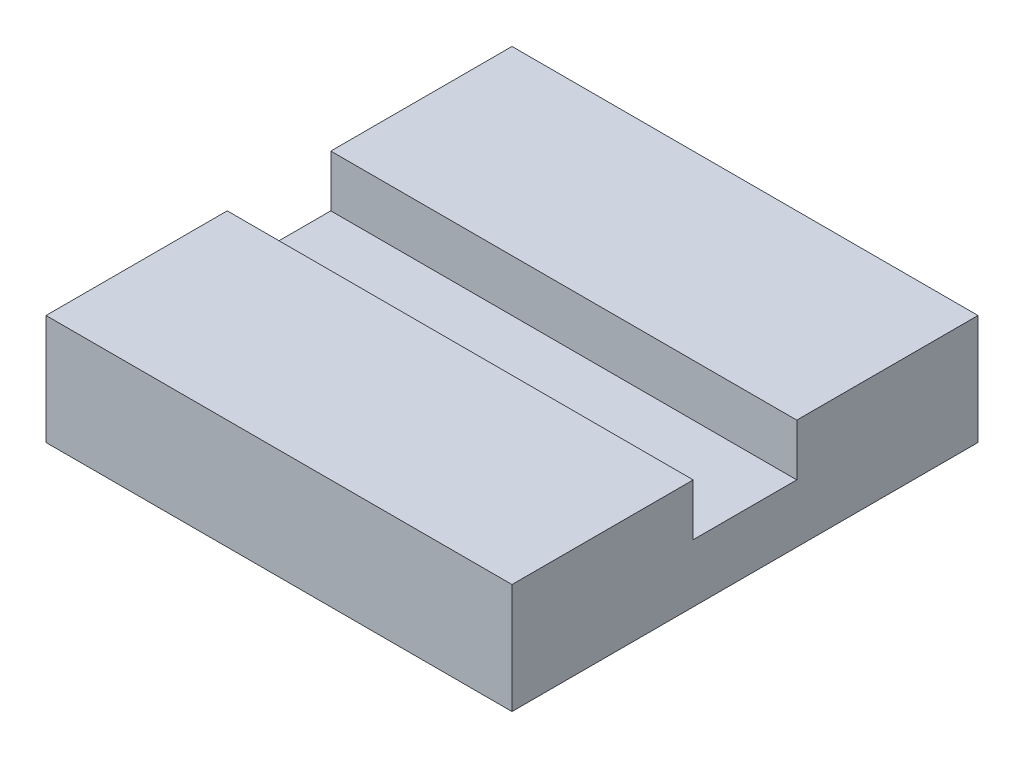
ISO-10303-21;
HEADER;
FILE_DESCRIPTION(('STEP AP214'),'2;1');
FILE_NAME('part.step','',(''),(''),'','','');
FILE_SCHEMA(('AUTOMOTIVE_DESIGN { 1 0 10303 214 1 1 1 1 }'));
ENDSEC;
DATA;
#1=APPLICATION_CONTEXT('core data for automotive mechanical design processes');
#2=APPLICATION_PROTOCOL_DEFINITION('international standard','automotive_design',2000,#1);
#3=PRODUCT_CONTEXT('',#1,'mechanical');
#4=PRODUCT('Part','Part','',(#3));
#5=PRODUCT_RELATED_PRODUCT_CATEGORY('part','',(#4));
#6=PRODUCT_DEFINITION_FORMATION('','',#4);
#7=PRODUCT_DEFINITION_CONTEXT('part definition',#1,'design');
#8=PRODUCT_DEFINITION('design','',#6,#7);
#9=PRODUCT_DEFINITION_SHAPE('','',#8);
#10=(LENGTH_UNIT() NAMED_UNIT(*) SI_UNIT(.MILLI.,.METRE.));
#11=(NAMED_UNIT(*) PLANE_ANGLE_UNIT() SI_UNIT($,.RADIAN.));
#12=(NAMED_UNIT(*) SI_UNIT($,.STERADIAN.) SOLID_ANGLE_UNIT());
#13=UNCERTAINTY_MEASURE_WITH_UNIT(LENGTH_MEASURE(1.E-05),#10,'distance_accuracy_value','');
#14=(GEOMETRIC_REPRESENTATION_CONTEXT(3) GLOBAL_UNCERTAINTY_ASSIGNED_CONTEXT((#13)) GLOBAL_UNIT_ASSIGNED_CONTEXT((#10,
#11,#12)) REPRESENTATION_CONTEXT('',''));
#15=CARTESIAN_POINT('',(0.,0.,0.));
#16=DIRECTION('',(0.,0.,1.));
#17=DIRECTION('',(1.,0.,0.));
#18=AXIS2_PLACEMENT_3D('',#15,#16,#17);
#19=CARTESIAN_POINT('',(0.,21.25,0.));
#20=DIRECTION('',(0.,1.,0.));
#21=DIRECTION('',(0.,0.,1.));
#22=AXIS2_PLACEMENT_3D('',#19,#20,#21);
#23=PLANE('',#22);
#24=DIRECTION('',(1.,0.,0.));
#25=VECTOR('',#24,1.);
#26=CARTESIAN_POINT('',(-45.,21.25,10.));
#27=LINE('',#26,#25);
#28=CARTESIAN_POINT('',(-45.,21.25,10.));
#29=VERTEX_POINT('',#28);
#30=CARTESIAN_POINT('',(45.,21.25,10.));
#31=VERTEX_POINT('',#30);
#32=EDGE_CURVE('E163',#29,#31,#27,.T.);
#33=ORIENTED_EDGE('',*,*,#32,.F.);
#34=DIRECTION('',(0.,0.,1.));
#35=VECTOR('',#34,1.);
#36=CARTESIAN_POINT('',(-45.,21.25,45.));
#37=LINE('',#36,#35);
#38=CARTESIAN_POINT('',(-45.,21.25,45.));
#39=VERTEX_POINT('',#38);
#40=EDGE_CURVE('E106',#29,#39,#37,.T.);
#41=ORIENTED_EDGE('',*,*,#40,.T.);
#42=DIRECTION('',(1.,0.,0.));
#43=VECTOR('',#42,1.);
#44=CARTESIAN_POINT('',(45.,21.25,45.));
#45=LINE('',#44,#43);
#46=CARTESIAN_POINT('',(45.,21.25,45.));
#47=VERTEX_POINT('',#46);
#48=EDGE_CURVE('E179',#39,#47,#45,.T.);
#49=ORIENTED_EDGE('',*,*,#48,.T.);
#50=DIRECTION('',(0.,0.,-1.));
#51=VECTOR('',#50,1.);
#52=CARTESIAN_POINT('',(45.,21.25,45.));
#53=LINE('',#52,#51);
#54=EDGE_CURVE('E183',#47,#31,#53,.T.);
#55=ORIENTED_EDGE('',*,*,#54,.T.);
#56=EDGE_LOOP('',(#33,#41,#49,#55));
#57=FACE_BOUND('',#56,.T.);
#58=ADVANCED_FACE('F51',(#57),#23,.T.);
#59=CARTESIAN_POINT('',(-45.,21.25,45.));
#60=DIRECTION('',(1.,0.,0.));
#61=DIRECTION('',(0.,0.,-1.));
#62=AXIS2_PLACEMENT_3D('',#59,#60,#61);
#63=PLANE('',#62);
#64=ORIENTED_EDGE('',*,*,#40,.F.);
#65=DIRECTION('',(0.,-1.,0.));
#66=VECTOR('',#65,1.);
#67=CARTESIAN_POINT('',(-45.,21.25,10.));
#68=LINE('',#67,#66);
#69=CARTESIAN_POINT('',(-45.,11.25,10.));
#70=VERTEX_POINT('',#69);
#71=EDGE_CURVE('E132',#29,#70,#68,.T.);
#72=ORIENTED_EDGE('',*,*,#71,.T.);
#73=DIRECTION('',(0.,0.,-1.));
#74=VECTOR('',#73,1.);
#75=CARTESIAN_POINT('',(-45.,11.25,10.));
#76=LINE('',#75,#74);
#77=CARTESIAN_POINT('',(-45.,11.25,-10.));
#78=VERTEX_POINT('',#77);
#79=EDGE_CURVE('E143',#70,#78,#76,.T.);
#80=ORIENTED_EDGE('',*,*,#79,.T.);
#81=DIRECTION('',(0.,1.,0.));
#82=VECTOR('',#81,1.);
#83=CARTESIAN_POINT('',(-45.,21.25,-10.));
#84=LINE('',#83,#82);
#85=CARTESIAN_POINT('',(-45.,21.25,-10.));
#86=VERTEX_POINT('',#85);
#87=EDGE_CURVE('E140',#78,#86,#84,.T.);
#88=ORIENTED_EDGE('',*,*,#87,.T.);
#89=CARTESIAN_POINT('',(-45.,21.25,-45.));
#90=VERTEX_POINT('',#89);
#91=EDGE_CURVE('E176',#90,#86,#37,.T.);
#92=ORIENTED_EDGE('',*,*,#91,.F.);
#93=DIRECTION('',(0.,-1.,0.));
#94=VECTOR('',#93,1.);
#95=CARTESIAN_POINT('',(-45.,21.25,-45.));
#96=LINE('',#95,#94);
#97=CARTESIAN_POINT('',(-45.,0.,-45.));
#98=VERTEX_POINT('',#97);
#99=EDGE_CURVE('E189',#90,#98,#96,.T.);
#100=ORIENTED_EDGE('',*,*,#99,.T.);
#101=DIRECTION('',(0.,0.,1.));
#102=VECTOR('',#101,1.);
#103=CARTESIAN_POINT('',(-45.,0.,45.));
#104=LINE('',#103,#102);
#105=CARTESIAN_POINT('',(-45.,0.,45.));
#106=VERTEX_POINT('',#105);
#107=EDGE_CURVE('E174',#98,#106,#104,.T.);
#108=ORIENTED_EDGE('',*,*,#107,.T.);
#109=DIRECTION('',(0.,-1.,0.));
#110=VECTOR('',#109,1.);
#111=CARTESIAN_POINT('',(-45.,21.25,45.));
#112=LINE('',#111,#110);
#113=EDGE_CURVE('E55',#39,#106,#112,.T.);
#114=ORIENTED_EDGE('',*,*,#113,.F.);
#115=EDGE_LOOP('',(#64,#72,#80,#88,#92,#100,#108,#114));
#116=FACE_BOUND('',#115,.T.);
#117=ADVANCED_FACE('F53',(#116),#63,.F.);
#118=CARTESIAN_POINT('',(45.,21.25,45.));
#119=DIRECTION('',(0.,0.,-1.));
#120=DIRECTION('',(-1.,0.,0.));
#121=AXIS2_PLACEMENT_3D('',#118,#119,#120);
#122=PLANE('',#121);
#123=DIRECTION('',(1.,0.,0.));
#124=VECTOR('',#123,1.);
#125=CARTESIAN_POINT('',(45.,0.,45.));
#126=LINE('',#125,#124);
#127=CARTESIAN_POINT('',(45.,0.,45.));
#128=VERTEX_POINT('',#127);
#129=EDGE_CURVE('E193',#106,#128,#126,.T.);
#130=ORIENTED_EDGE('',*,*,#129,.T.);
#131=DIRECTION('',(0.,-1.,0.));
#132=VECTOR('',#131,1.);
#133=CARTESIAN_POINT('',(45.,21.25,45.));
#134=LINE('',#133,#132);
#135=EDGE_CURVE('E205',#47,#128,#134,.T.);
#136=ORIENTED_EDGE('',*,*,#135,.F.);
#137=ORIENTED_EDGE('',*,*,#48,.F.);
#138=ORIENTED_EDGE('',*,*,#113,.T.);
#139=EDGE_LOOP('',(#130,#136,#137,#138));
#140=FACE_BOUND('',#139,.T.);
#141=ADVANCED_FACE('F215',(#140),#122,.F.);
#142=CARTESIAN_POINT('',(45.,21.25,45.));
#143=DIRECTION('',(-1.,0.,0.));
#144=DIRECTION('',(0.,0.,1.));
#145=AXIS2_PLACEMENT_3D('',#142,#143,#144);
#146=PLANE('',#145);
#147=DIRECTION('',(0.,0.,-1.));
#148=VECTOR('',#147,1.);
#149=CARTESIAN_POINT('',(45.,11.25,10.));
#150=LINE('',#149,#148);
#151=CARTESIAN_POINT('',(45.,11.25,10.));
#152=VERTEX_POINT('',#151);
#153=CARTESIAN_POINT('',(45.,11.25,-10.));
#154=VERTEX_POINT('',#153);
#155=EDGE_CURVE('E154',#152,#154,#150,.T.);
#156=ORIENTED_EDGE('',*,*,#155,.F.);
#157=DIRECTION('',(0.,-1.,0.));
#158=VECTOR('',#157,1.);
#159=CARTESIAN_POINT('',(45.,21.25,10.));
#160=LINE('',#159,#158);
#161=EDGE_CURVE('E134',#31,#152,#160,.T.);
#162=ORIENTED_EDGE('',*,*,#161,.F.);
#163=ORIENTED_EDGE('',*,*,#54,.F.);
#164=ORIENTED_EDGE('',*,*,#135,.T.);
#165=DIRECTION('',(0.,0.,-1.));
#166=VECTOR('',#165,1.);
#167=CARTESIAN_POINT('',(45.,0.,45.));
#168=LINE('',#167,#166);
#169=CARTESIAN_POINT('',(45.,0.,-45.));
#170=VERTEX_POINT('',#169);
#171=EDGE_CURVE('E196',#128,#170,#168,.T.);
#172=ORIENTED_EDGE('',*,*,#171,.T.);
#173=DIRECTION('',(0.,-1.,0.));
#174=VECTOR('',#173,1.);
#175=CARTESIAN_POINT('',(45.,21.25,-45.));
#176=LINE('',#175,#174);
#177=CARTESIAN_POINT('',(45.,21.25,-45.));
#178=VERTEX_POINT('',#177);
#179=EDGE_CURVE('E203',#178,#170,#176,.T.);
#180=ORIENTED_EDGE('',*,*,#179,.F.);
#181=CARTESIAN_POINT('',(45.,21.25,-9.99999999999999));
#182=VERTEX_POINT('',#181);
#183=EDGE_CURVE('E182',#182,#178,#53,.T.);
#184=ORIENTED_EDGE('',*,*,#183,.F.);
#185=DIRECTION('',(0.,1.,0.));
#186=VECTOR('',#185,1.);
#187=CARTESIAN_POINT('',(45.,21.25,-10.));
#188=LINE('',#187,#186);
#189=EDGE_CURVE('E68',#154,#182,#188,.T.);
#190=ORIENTED_EDGE('',*,*,#189,.F.);
#191=EDGE_LOOP('',(#156,#162,#163,#164,#172,#180,#184,#190));
#192=FACE_BOUND('',#191,.T.);
#193=ADVANCED_FACE('F221',(#192),#146,.F.);
#194=CARTESIAN_POINT('',(45.,21.25,-45.));
#195=DIRECTION('',(0.,0.,1.));
#196=DIRECTION('',(1.,0.,0.));
#197=AXIS2_PLACEMENT_3D('',#194,#195,#196);
#198=PLANE('',#197);
#199=DIRECTION('',(-1.,0.,0.));
#200=VECTOR('',#199,1.);
#201=CARTESIAN_POINT('',(45.,0.,-45.));
#202=LINE('',#201,#200);
#203=EDGE_CURVE('E98',#170,#98,#202,.T.);
#204=ORIENTED_EDGE('',*,*,#203,.T.);
#205=ORIENTED_EDGE('',*,*,#99,.F.);
#206=DIRECTION('',(-1.,0.,0.));
#207=VECTOR('',#206,1.);
#208=CARTESIAN_POINT('',(45.,21.25,-45.));
#209=LINE('',#208,#207);
#210=EDGE_CURVE('E77',#178,#90,#209,.T.);
#211=ORIENTED_EDGE('',*,*,#210,.F.);
#212=ORIENTED_EDGE('',*,*,#179,.T.);
#213=EDGE_LOOP('',(#204,#205,#211,#212));
#214=FACE_BOUND('',#213,.T.);
#215=ADVANCED_FACE('F223',(#214),#198,.F.);
#216=DIRECTION('',(1.,0.,0.));
#217=VECTOR('',#216,1.);
#218=CARTESIAN_POINT('',(-45.,21.25,-10.));
#219=LINE('',#218,#217);
#220=EDGE_CURVE('E167',#86,#182,#219,.T.);
#221=ORIENTED_EDGE('',*,*,#220,.T.);
#222=ORIENTED_EDGE('',*,*,#183,.T.);
#223=ORIENTED_EDGE('',*,*,#210,.T.);
#224=ORIENTED_EDGE('',*,*,#91,.T.);
#225=EDGE_LOOP('',(#221,#222,#223,#224));
#226=FACE_BOUND('',#225,.T.);
#227=ADVANCED_FACE('F224',(#226),#23,.T.);
#228=CARTESIAN_POINT('',(0.,0.,0.));
#229=DIRECTION('',(0.,1.,0.));
#230=DIRECTION('',(0.,0.,1.));
#231=AXIS2_PLACEMENT_3D('',#228,#229,#230);
#232=PLANE('',#231);
#233=CARTESIAN_POINT('',(0.,0.,0.));
#234=DIRECTION('',(0.,-1.,0.));
#235=DIRECTION('',(0.,0.,-1.));
#236=AXIS2_PLACEMENT_3D('',#233,#234,#235);
#237=CIRCLE('',#236,10.);
#238=CARTESIAN_POINT('',(0.,0.,-10.));
#239=VERTEX_POINT('',#238);
#240=EDGE_CURVE('E11',#239,#239,#237,.T.);
#241=ORIENTED_EDGE('',*,*,#240,.F.);
#242=EDGE_LOOP('',(#241));
#243=FACE_BOUND('',#242,.T.);
#244=ORIENTED_EDGE('',*,*,#107,.F.);
#245=ORIENTED_EDGE('',*,*,#203,.F.);
#246=ORIENTED_EDGE('',*,*,#171,.F.);
#247=ORIENTED_EDGE('',*,*,#129,.F.);
#248=EDGE_LOOP('',(#244,#245,#246,#247));
#249=FACE_BOUND('',#248,.T.);
#250=ADVANCED_FACE('F219',(#243,#249),#232,.F.);
#251=CARTESIAN_POINT('',(0.,-20.,0.));
#252=DIRECTION('',(0.,1.,0.));
#253=DIRECTION('',(0.,0.,1.));
#254=AXIS2_PLACEMENT_3D('',#251,#252,#253);
#255=CYLINDRICAL_SURFACE('',#254,10.);
#256=CARTESIAN_POINT('',(0.,-20.,0.));
#257=DIRECTION('',(0.,-1.,0.));
#258=DIRECTION('',(0.,0.,-1.));
#259=AXIS2_PLACEMENT_3D('',#256,#257,#258);
#260=CIRCLE('',#259,10.);
#261=CARTESIAN_POINT('',(0.,-20.,-10.));
#262=VERTEX_POINT('',#261);
#263=EDGE_CURVE('E166',#262,#262,#260,.T.);
#264=ORIENTED_EDGE('',*,*,#263,.F.);
#265=EDGE_LOOP('',(#264));
#266=FACE_BOUND('',#265,.T.);
#267=ORIENTED_EDGE('',*,*,#240,.T.);
#268=EDGE_LOOP('',(#267));
#269=FACE_BOUND('',#268,.T.);
#270=ADVANCED_FACE('F240',(#266,#269),#255,.T.);
#271=CARTESIAN_POINT('',(0.,-20.,0.));
#272=DIRECTION('',(0.,-1.,0.));
#273=DIRECTION('',(0.,0.,-1.));
#274=AXIS2_PLACEMENT_3D('',#271,#272,#273);
#275=PLANE('',#274);
#276=ORIENTED_EDGE('',*,*,#263,.T.);
#277=EDGE_LOOP('',(#276));
#278=FACE_BOUND('',#277,.T.);
#279=ADVANCED_FACE('F275',(#278),#275,.T.);
#280=CARTESIAN_POINT('',(-45.,21.25,10.));
#281=DIRECTION('',(0.,0.,1.));
#282=DIRECTION('',(0.,-1.,0.));
#283=AXIS2_PLACEMENT_3D('',#280,#281,#282);
#284=PLANE('',#283);
#285=ORIENTED_EDGE('',*,*,#161,.T.);
#286=DIRECTION('',(1.,0.,0.));
#287=VECTOR('',#286,1.);
#288=CARTESIAN_POINT('',(-45.,11.25,10.));
#289=LINE('',#288,#287);
#290=EDGE_CURVE('E128',#70,#152,#289,.T.);
#291=ORIENTED_EDGE('',*,*,#290,.F.);
#292=ORIENTED_EDGE('',*,*,#71,.F.);
#293=ORIENTED_EDGE('',*,*,#32,.T.);
#294=EDGE_LOOP('',(#285,#291,#292,#293));
#295=FACE_BOUND('',#294,.T.);
#296=ADVANCED_FACE('F130',(#295),#284,.F.);
#297=CARTESIAN_POINT('',(-45.,21.25,-10.));
#298=DIRECTION('',(0.,0.,-1.));
#299=DIRECTION('',(0.,1.,0.));
#300=AXIS2_PLACEMENT_3D('',#297,#298,#299);
#301=PLANE('',#300);
#302=ORIENTED_EDGE('',*,*,#189,.T.);
#303=ORIENTED_EDGE('',*,*,#220,.F.);
#304=ORIENTED_EDGE('',*,*,#87,.F.);
#305=DIRECTION('',(1.,0.,0.));
#306=VECTOR('',#305,1.);
#307=CARTESIAN_POINT('',(-45.,11.25,-10.));
#308=LINE('',#307,#306);
#309=EDGE_CURVE('E139',#78,#154,#308,.T.);
#310=ORIENTED_EDGE('',*,*,#309,.T.);
#311=EDGE_LOOP('',(#302,#303,#304,#310));
#312=FACE_BOUND('',#311,.T.);
#313=ADVANCED_FACE('F309',(#312),#301,.F.);
#314=CARTESIAN_POINT('',(-45.,11.25,10.));
#315=DIRECTION('',(0.,-1.,0.));
#316=DIRECTION('',(0.,0.,-1.));
#317=AXIS2_PLACEMENT_3D('',#314,#315,#316);
#318=PLANE('',#317);
#319=ORIENTED_EDGE('',*,*,#155,.T.);
#320=ORIENTED_EDGE('',*,*,#309,.F.);
#321=ORIENTED_EDGE('',*,*,#79,.F.);
#322=ORIENTED_EDGE('',*,*,#290,.T.);
#323=EDGE_LOOP('',(#319,#320,#321,#322));
#324=FACE_BOUND('',#323,.T.);
#325=ADVANCED_FACE('F144',(#324),#318,.F.);
#326=CLOSED_SHELL('',(#58,#117,#141,#193,#215,#227,#250,#270,#279,#296,#313,#325));
#327=MANIFOLD_SOLID_BREP('B2',#326);
#328=ADVANCED_BREP_SHAPE_REPRESENTATION('',(#18,#327),#14);
#329=SHAPE_DEFINITION_REPRESENTATION(#9,#328);
ENDSEC;
END-ISO-10303-21;
